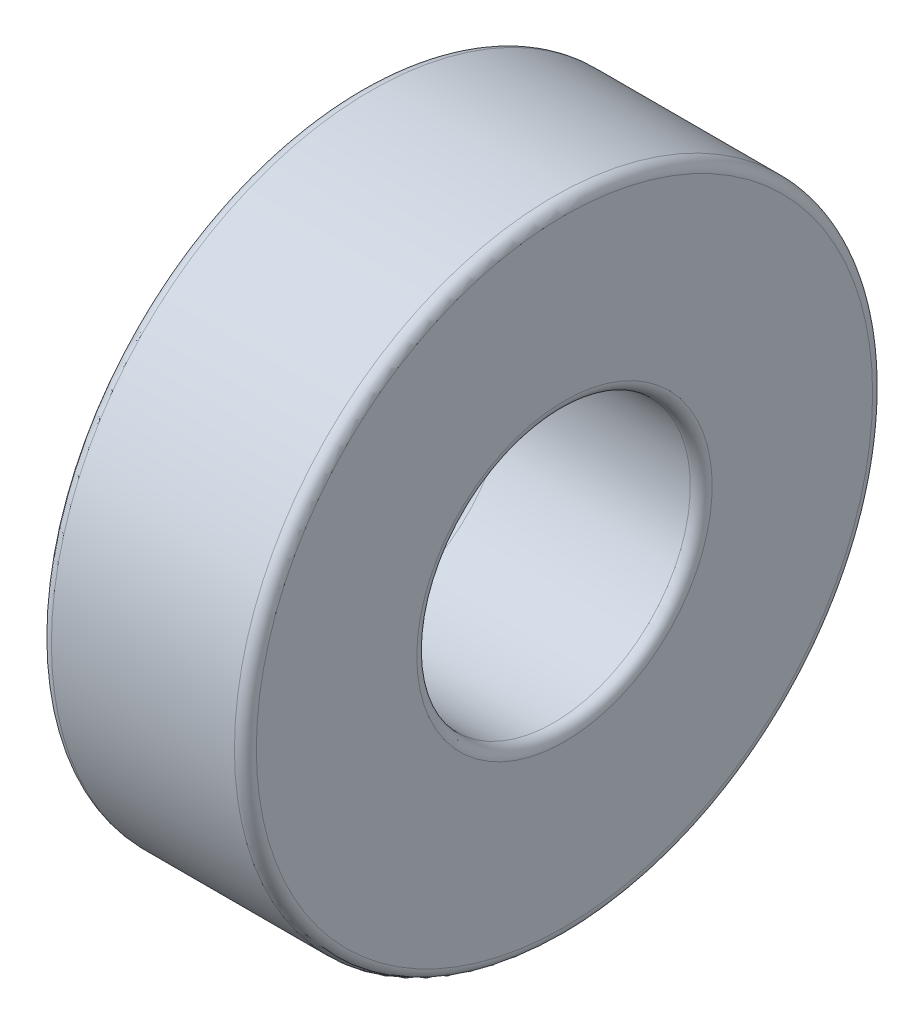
from build123d import *

# Parameters (mm, degrees)
SKETCH1_W = 7.1374
SKETCH1_H = 6.35
FILLET1_R = 0.381


with BuildPart() as part:
    # Sketch1 → Revolve1 (revolve)
    with BuildSketch(Plane.XY, mode=Mode.PRIVATE) as revolve1_sk:
        with Locations((3.5687, 7.9375)):
            Rectangle(SKETCH1_W, SKETCH1_H)
    revolve(revolve1_sk.sketch.rotate(Axis((0, 0, 0), (1, 0, 0)), 90), axis=Axis((0, 0, 0), (1, 0, 0)))

    # Fillet1
    fillet1_edges = [part.edges().sort_by_distance(p)[0] for p in [
        (0, 0, -11.1125),
        (7.1374, 0, -11.1125),
        (7.1374, 0, -4.7625),
        (0, 0, -4.7625),
    ]]
    fillet(fillet1_edges, radius=FILLET1_R)


solid = part.part
